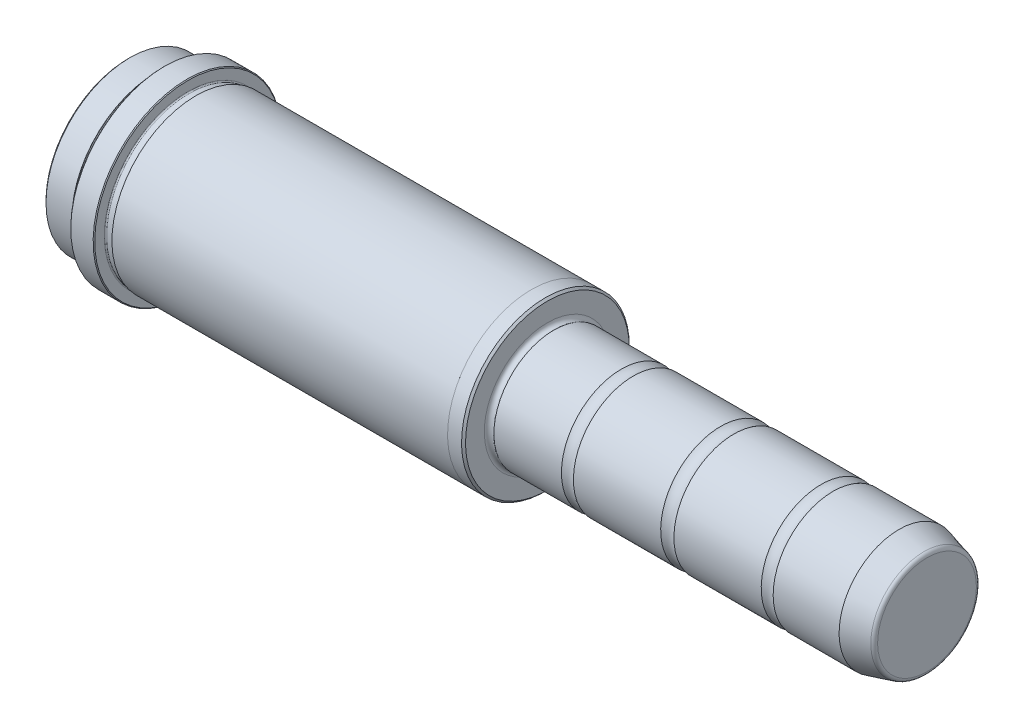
ISO-10303-21;
HEADER;
FILE_DESCRIPTION(('STEP AP214'),'2;1');
FILE_NAME('part.step','',(''),(''),'','','');
FILE_SCHEMA(('AUTOMOTIVE_DESIGN { 1 0 10303 214 1 1 1 1 }'));
ENDSEC;
DATA;
#1=APPLICATION_CONTEXT('core data for automotive mechanical design processes');
#2=APPLICATION_PROTOCOL_DEFINITION('international standard','automotive_design',2000,#1);
#3=PRODUCT_CONTEXT('',#1,'mechanical');
#4=PRODUCT('Part','Part','',(#3));
#5=PRODUCT_RELATED_PRODUCT_CATEGORY('part','',(#4));
#6=PRODUCT_DEFINITION_FORMATION('','',#4);
#7=PRODUCT_DEFINITION_CONTEXT('part definition',#1,'design');
#8=PRODUCT_DEFINITION('design','',#6,#7);
#9=PRODUCT_DEFINITION_SHAPE('','',#8);
#10=(LENGTH_UNIT() NAMED_UNIT(*) SI_UNIT(.MILLI.,.METRE.));
#11=(NAMED_UNIT(*) PLANE_ANGLE_UNIT() SI_UNIT($,.RADIAN.));
#12=(NAMED_UNIT(*) SI_UNIT($,.STERADIAN.) SOLID_ANGLE_UNIT());
#13=UNCERTAINTY_MEASURE_WITH_UNIT(LENGTH_MEASURE(1.E-05),#10,'distance_accuracy_value','');
#14=(GEOMETRIC_REPRESENTATION_CONTEXT(3) GLOBAL_UNCERTAINTY_ASSIGNED_CONTEXT((#13)) GLOBAL_UNIT_ASSIGNED_CONTEXT((#10,
#11,#12)) REPRESENTATION_CONTEXT('',''));
#15=CARTESIAN_POINT('',(0.,0.,0.));
#16=DIRECTION('',(0.,0.,1.));
#17=DIRECTION('',(1.,0.,0.));
#18=AXIS2_PLACEMENT_3D('',#15,#16,#17);
#19=CARTESIAN_POINT('',(95.,0.,0.));
#20=DIRECTION('',(1.,0.,0.));
#21=DIRECTION('',(0.,1.,0.));
#22=AXIS2_PLACEMENT_3D('',#19,#20,#21);
#23=CYLINDRICAL_SURFACE('',#22,15.);
#24=CARTESIAN_POINT('',(1.6,0.,0.));
#25=DIRECTION('',(1.,0.,0.));
#26=DIRECTION('',(0.,1.,0.));
#27=AXIS2_PLACEMENT_3D('',#24,#25,#26);
#28=CIRCLE('',#27,15.);
#29=CARTESIAN_POINT('',(1.6,15.,0.));
#30=VERTEX_POINT('',#29);
#31=EDGE_CURVE('E105',#30,#30,#28,.T.);
#32=ORIENTED_EDGE('',*,*,#31,.T.);
#33=EDGE_LOOP('',(#32));
#34=FACE_BOUND('',#33,.T.);
#35=CARTESIAN_POINT('',(18.5033370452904,0.,0.));
#36=DIRECTION('',(-1.,0.,0.));
#37=DIRECTION('',(0.,-1.,0.));
#38=AXIS2_PLACEMENT_3D('',#35,#36,#37);
#39=CIRCLE('',#38,15.);
#40=CARTESIAN_POINT('',(18.5033370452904,-15.,0.));
#41=VERTEX_POINT('',#40);
#42=EDGE_CURVE('E126',#41,#41,#39,.T.);
#43=ORIENTED_EDGE('',*,*,#42,.T.);
#44=EDGE_LOOP('',(#43));
#45=FACE_BOUND('',#44,.T.);
#46=ADVANCED_FACE('F28',(#34,#45),#23,.T.);
#47=CARTESIAN_POINT('',(-105.,21.,0.));
#48=DIRECTION('',(-1.,0.,0.));
#49=DIRECTION('',(0.,-1.,0.));
#50=AXIS2_PLACEMENT_3D('',#47,#48,#49);
#51=PLANE('',#50);
#52=CARTESIAN_POINT('',(-105.,0.,0.));
#53=DIRECTION('',(-1.,0.,0.));
#54=DIRECTION('',(0.,-1.,0.));
#55=AXIS2_PLACEMENT_3D('',#52,#53,#54);
#56=CIRCLE('',#55,20.5);
#57=CARTESIAN_POINT('',(-105.,-20.5,0.));
#58=VERTEX_POINT('',#57);
#59=EDGE_CURVE('E39',#58,#58,#56,.T.);
#60=ORIENTED_EDGE('',*,*,#59,.T.);
#61=EDGE_LOOP('',(#60));
#62=FACE_BOUND('',#61,.T.);
#63=ADVANCED_FACE('F149',(#62),#51,.T.);
#64=CARTESIAN_POINT('',(95.,0.,0.));
#65=DIRECTION('',(1.,0.,0.));
#66=DIRECTION('',(0.,1.,0.));
#67=AXIS2_PLACEMENT_3D('',#64,#65,#66);
#68=CYLINDRICAL_SURFACE('',#67,21.);
#69=CARTESIAN_POINT('',(-104.5,0.,0.));
#70=DIRECTION('',(-1.,0.,0.));
#71=DIRECTION('',(0.,-1.,0.));
#72=AXIS2_PLACEMENT_3D('',#69,#70,#71);
#73=CIRCLE('',#72,21.);
#74=CARTESIAN_POINT('',(-104.5,-21.,0.));
#75=VERTEX_POINT('',#74);
#76=EDGE_CURVE('E43',#75,#75,#73,.F.);
#77=ORIENTED_EDGE('',*,*,#76,.T.);
#78=EDGE_LOOP('',(#77));
#79=FACE_BOUND('',#78,.T.);
#80=CARTESIAN_POINT('',(-98.,0.,0.));
#81=DIRECTION('',(1.,0.,0.));
#82=DIRECTION('',(0.,1.,0.));
#83=AXIS2_PLACEMENT_3D('',#80,#81,#82);
#84=CIRCLE('',#83,21.);
#85=CARTESIAN_POINT('',(-98.,21.,0.));
#86=VERTEX_POINT('',#85);
#87=EDGE_CURVE('E66',#86,#86,#84,.T.);
#88=ORIENTED_EDGE('',*,*,#87,.F.);
#89=EDGE_LOOP('',(#88));
#90=FACE_BOUND('',#89,.T.);
#91=ADVANCED_FACE('F157',(#79,#90),#68,.T.);
#92=CARTESIAN_POINT('',(-98.,20.9,0.));
#93=DIRECTION('',(1.,0.,0.));
#94=DIRECTION('',(0.,1.,0.));
#95=AXIS2_PLACEMENT_3D('',#92,#93,#94);
#96=PLANE('',#95);
#97=ORIENTED_EDGE('',*,*,#87,.T.);
#98=EDGE_LOOP('',(#97));
#99=FACE_BOUND('',#98,.T.);
#100=CARTESIAN_POINT('',(-98.,0.,0.));
#101=DIRECTION('',(1.,0.,0.));
#102=DIRECTION('',(0.,1.,0.));
#103=AXIS2_PLACEMENT_3D('',#100,#101,#102);
#104=CIRCLE('',#103,20.9);
#105=CARTESIAN_POINT('',(-98.,20.9,0.));
#106=VERTEX_POINT('',#105);
#107=EDGE_CURVE('E69',#106,#106,#104,.T.);
#108=ORIENTED_EDGE('',*,*,#107,.F.);
#109=EDGE_LOOP('',(#108));
#110=FACE_BOUND('',#109,.T.);
#111=ADVANCED_FACE('F405',(#99,#110),#96,.T.);
#112=CARTESIAN_POINT('',(-97.7,0.,0.));
#113=DIRECTION('',(1.,0.,0.));
#114=DIRECTION('',(0.,1.,0.));
#115=AXIS2_PLACEMENT_3D('',#112,#113,#114);
#116=TOROIDAL_SURFACE('',#115,20.9,0.299999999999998);
#117=ORIENTED_EDGE('',*,*,#107,.T.);
#118=EDGE_LOOP('',(#117));
#119=FACE_BOUND('',#118,.T.);
#120=CARTESIAN_POINT('',(-97.7,0.,0.));
#121=DIRECTION('',(1.,0.,0.));
#122=DIRECTION('',(0.,1.,0.));
#123=AXIS2_PLACEMENT_3D('',#120,#121,#122);
#124=CIRCLE('',#123,20.6);
#125=CARTESIAN_POINT('',(-97.7,20.6,0.));
#126=VERTEX_POINT('',#125);
#127=EDGE_CURVE('E72',#126,#126,#124,.T.);
#128=ORIENTED_EDGE('',*,*,#127,.F.);
#129=EDGE_LOOP('',(#128));
#130=FACE_BOUND('',#129,.T.);
#131=ADVANCED_FACE('F396',(#119,#130),#116,.F.);
#132=CARTESIAN_POINT('',(95.,0.,0.));
#133=DIRECTION('',(1.,0.,0.));
#134=DIRECTION('',(0.,1.,0.));
#135=AXIS2_PLACEMENT_3D('',#132,#133,#134);
#136=CYLINDRICAL_SURFACE('',#135,20.6);
#137=ORIENTED_EDGE('',*,*,#127,.T.);
#138=EDGE_LOOP('',(#137));
#139=FACE_BOUND('',#138,.T.);
#140=CARTESIAN_POINT('',(-96.3,0.,0.));
#141=DIRECTION('',(1.,0.,0.));
#142=DIRECTION('',(0.,1.,0.));
#143=AXIS2_PLACEMENT_3D('',#140,#141,#142);
#144=CIRCLE('',#143,20.6);
#145=CARTESIAN_POINT('',(-96.3,20.6,0.));
#146=VERTEX_POINT('',#145);
#147=EDGE_CURVE('E75',#146,#146,#144,.T.);
#148=ORIENTED_EDGE('',*,*,#147,.F.);
#149=EDGE_LOOP('',(#148));
#150=FACE_BOUND('',#149,.T.);
#151=ADVANCED_FACE('F387',(#139,#150),#136,.T.);
#152=CARTESIAN_POINT('',(-96.3,0.,0.));
#153=DIRECTION('',(1.,0.,0.));
#154=DIRECTION('',(0.,1.,0.));
#155=AXIS2_PLACEMENT_3D('',#152,#153,#154);
#156=TOROIDAL_SURFACE('',#155,20.9,0.299999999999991);
#157=ORIENTED_EDGE('',*,*,#147,.T.);
#158=EDGE_LOOP('',(#157));
#159=FACE_BOUND('',#158,.T.);
#160=CARTESIAN_POINT('',(-96.,0.,0.));
#161=DIRECTION('',(1.,0.,0.));
#162=DIRECTION('',(0.,1.,0.));
#163=AXIS2_PLACEMENT_3D('',#160,#161,#162);
#164=CIRCLE('',#163,20.9);
#165=CARTESIAN_POINT('',(-96.,20.9,0.));
#166=VERTEX_POINT('',#165);
#167=EDGE_CURVE('E78',#166,#166,#164,.T.);
#168=ORIENTED_EDGE('',*,*,#167,.F.);
#169=EDGE_LOOP('',(#168));
#170=FACE_BOUND('',#169,.T.);
#171=ADVANCED_FACE('F379',(#159,#170),#156,.F.);
#172=CARTESIAN_POINT('',(-96.,23.5,0.));
#173=DIRECTION('',(-1.,0.,0.));
#174=DIRECTION('',(0.,-1.,0.));
#175=AXIS2_PLACEMENT_3D('',#172,#173,#174);
#176=PLANE('',#175);
#177=CARTESIAN_POINT('',(-96.,0.,0.));
#178=DIRECTION('',(-1.,0.,0.));
#179=DIRECTION('',(0.,-1.,0.));
#180=AXIS2_PLACEMENT_3D('',#177,#178,#179);
#181=CIRCLE('',#180,23.3);
#182=CARTESIAN_POINT('',(-96.,23.3,0.));
#183=VERTEX_POINT('',#182);
#184=EDGE_CURVE('E51',#183,#183,#181,.T.);
#185=ORIENTED_EDGE('',*,*,#184,.T.);
#186=EDGE_LOOP('',(#185));
#187=FACE_BOUND('',#186,.T.);
#188=ORIENTED_EDGE('',*,*,#167,.T.);
#189=EDGE_LOOP('',(#188));
#190=FACE_BOUND('',#189,.T.);
#191=ADVANCED_FACE('F371',(#187,#190),#176,.T.);
#192=CARTESIAN_POINT('',(95.,0.,0.));
#193=DIRECTION('',(1.,0.,0.));
#194=DIRECTION('',(0.,1.,0.));
#195=AXIS2_PLACEMENT_3D('',#192,#193,#194);
#196=CYLINDRICAL_SURFACE('',#195,23.5);
#197=CARTESIAN_POINT('',(-95.8000000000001,0.,0.));
#198=DIRECTION('',(-1.,0.,0.));
#199=DIRECTION('',(0.,-1.,0.));
#200=AXIS2_PLACEMENT_3D('',#197,#198,#199);
#201=CIRCLE('',#200,23.5);
#202=CARTESIAN_POINT('',(-95.8000000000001,23.5,0.));
#203=VERTEX_POINT('',#202);
#204=EDGE_CURVE('E54',#203,#203,#201,.F.);
#205=CARTESIAN_POINT('',(-90.2,0.,0.));
#206=DIRECTION('',(1.,0.,0.));
#207=DIRECTION('',(0.,1.,0.));
#208=AXIS2_PLACEMENT_3D('',#205,#206,#207);
#209=CIRCLE('',#208,23.5);
#210=CARTESIAN_POINT('',(-90.2,23.5,0.));
#211=VERTEX_POINT('',#210);
#212=EDGE_CURVE('E57',#211,#211,#209,.F.);
#213=CARTESIAN_POINT('',(-95.8000000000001,23.5,0.));
#214=CARTESIAN_POINT('',(-95.7416666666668,23.5,0.));
#215=CARTESIAN_POINT('',(-95.6833333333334,23.5,0.));
#216=CARTESIAN_POINT('',(-95.5666666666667,23.5,0.));
#217=CARTESIAN_POINT('',(-95.5083333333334,23.5,0.));
#218=CARTESIAN_POINT('',(-95.3916666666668,23.5,0.));
#219=CARTESIAN_POINT('',(-95.3333333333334,23.5,0.));
#220=CARTESIAN_POINT('',(-95.2166666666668,23.5,0.));
#221=CARTESIAN_POINT('',(-95.1583333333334,23.5,0.));
#222=CARTESIAN_POINT('',(-95.0416666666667,23.5,0.));
#223=CARTESIAN_POINT('',(-94.9833333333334,23.5,0.));
#224=CARTESIAN_POINT('',(-94.8666666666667,23.5,0.));
#225=CARTESIAN_POINT('',(-94.8083333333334,23.5,0.));
#226=CARTESIAN_POINT('',(-94.6916666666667,23.5,0.));
#227=CARTESIAN_POINT('',(-94.6333333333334,23.5,0.));
#228=CARTESIAN_POINT('',(-94.5166666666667,23.5,0.));
#229=CARTESIAN_POINT('',(-94.4583333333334,23.5,0.));
#230=CARTESIAN_POINT('',(-94.3416666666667,23.5,0.));
#231=CARTESIAN_POINT('',(-94.2833333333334,23.5,0.));
#232=CARTESIAN_POINT('',(-94.1666666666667,23.5,0.));
#233=CARTESIAN_POINT('',(-94.1083333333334,23.5,0.));
#234=CARTESIAN_POINT('',(-93.9916666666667,23.5,0.));
#235=CARTESIAN_POINT('',(-93.9333333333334,23.5,0.));
#236=CARTESIAN_POINT('',(-93.8166666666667,23.5,0.));
#237=CARTESIAN_POINT('',(-93.7583333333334,23.5,0.));
#238=CARTESIAN_POINT('',(-93.6416666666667,23.5,0.));
#239=CARTESIAN_POINT('',(-93.5833333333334,23.5,0.));
#240=CARTESIAN_POINT('',(-93.4666666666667,23.5,0.));
#241=CARTESIAN_POINT('',(-93.4083333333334,23.5,0.));
#242=CARTESIAN_POINT('',(-93.2916666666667,23.5,0.));
#243=CARTESIAN_POINT('',(-93.2333333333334,23.5,0.));
#244=CARTESIAN_POINT('',(-93.1166666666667,23.5,0.));
#245=CARTESIAN_POINT('',(-93.0583333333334,23.5,0.));
#246=CARTESIAN_POINT('',(-92.9416666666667,23.5,0.));
#247=CARTESIAN_POINT('',(-92.8833333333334,23.5,0.));
#248=CARTESIAN_POINT('',(-92.7666666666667,23.5,0.));
#249=CARTESIAN_POINT('',(-92.7083333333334,23.5,0.));
#250=CARTESIAN_POINT('',(-92.5916666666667,23.5,0.));
#251=CARTESIAN_POINT('',(-92.5333333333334,23.5,0.));
#252=CARTESIAN_POINT('',(-92.4166666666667,23.5,0.));
#253=CARTESIAN_POINT('',(-92.3583333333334,23.5,0.));
#254=CARTESIAN_POINT('',(-92.2416666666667,23.5,0.));
#255=CARTESIAN_POINT('',(-92.1833333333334,23.5,0.));
#256=CARTESIAN_POINT('',(-92.0666666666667,23.5,0.));
#257=CARTESIAN_POINT('',(-92.0083333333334,23.5,0.));
#258=CARTESIAN_POINT('',(-91.8916666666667,23.5,0.));
#259=CARTESIAN_POINT('',(-91.8333333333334,23.5,0.));
#260=CARTESIAN_POINT('',(-91.7166666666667,23.5,0.));
#261=CARTESIAN_POINT('',(-91.6583333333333,23.5,0.));
#262=CARTESIAN_POINT('',(-91.5416666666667,23.5,0.));
#263=CARTESIAN_POINT('',(-91.4833333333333,23.5,0.));
#264=CARTESIAN_POINT('',(-91.3666666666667,23.5,0.));
#265=CARTESIAN_POINT('',(-91.3083333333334,23.5,0.));
#266=CARTESIAN_POINT('',(-91.1916666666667,23.5,0.));
#267=CARTESIAN_POINT('',(-91.1333333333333,23.5,0.));
#268=CARTESIAN_POINT('',(-91.0166666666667,23.5,0.));
#269=CARTESIAN_POINT('',(-90.9583333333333,23.5,0.));
#270=CARTESIAN_POINT('',(-90.8416666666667,23.5,0.));
#271=CARTESIAN_POINT('',(-90.7833333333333,23.5,0.));
#272=CARTESIAN_POINT('',(-90.6666666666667,23.5,0.));
#273=CARTESIAN_POINT('',(-90.6083333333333,23.5,0.));
#274=CARTESIAN_POINT('',(-90.4916666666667,23.5,0.));
#275=CARTESIAN_POINT('',(-90.4333333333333,23.5,0.));
#276=CARTESIAN_POINT('',(-90.3166666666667,23.5,0.));
#277=CARTESIAN_POINT('',(-90.2583333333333,23.5,0.));
#278=CARTESIAN_POINT('',(-90.2,23.5,0.));
#279=B_SPLINE_CURVE_WITH_KNOTS('',3,(#213,#214,#215,#216,#217,#218,#219,#220,#221,#222,#223,
#224,#225,#226,#227,#228,#229,#230,#231,#232,#233,#234,#235,#236,#237,#238,#239,#240,#241,#242,
#243,#244,#245,#246,#247,#248,#249,#250,#251,#252,#253,#254,#255,#256,#257,#258,#259,#260,#261,
#262,#263,#264,#265,#266,#267,#268,#269,#270,#271,#272,#273,#274,#275,#276,#277,#278),
.UNSPECIFIED.,.F.,.F.,(4,2,2,2,2,2,2,2,2,2,2,2,2,2,2,2,2,2,2,2,2,2,2,2,2,2,2,2,2,2,2,2,4),(0.,
0.175000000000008,0.350000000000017,0.524999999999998,0.700000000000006,0.875000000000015,
1.05000000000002,1.22500000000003,1.40000000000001,1.57500000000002,1.75000000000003,
1.92500000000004,2.10000000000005,2.27500000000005,2.45000000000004,2.62500000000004,
2.80000000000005,2.97500000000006,3.15000000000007,3.32500000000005,3.50000000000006,
3.67500000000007,3.85000000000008,4.02500000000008,4.20000000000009,4.37500000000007,
4.55000000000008,4.72500000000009,4.9000000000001,5.07500000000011,5.25000000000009,
5.4250000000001,5.6000000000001),.UNSPECIFIED.);
#280=EDGE_CURVE('BSEAM362',#203,#211,#279,.T.);
#281=ORIENTED_EDGE('',*,*,#204,.T.);
#282=ORIENTED_EDGE('',*,*,#212,.T.);
#283=ORIENTED_EDGE('',*,*,#280,.T.);
#284=ORIENTED_EDGE('',*,*,#280,.F.);
#285=EDGE_LOOP('',(#281,#283,#282,#284));
#286=FACE_BOUND('',#285,.T.);
#287=ADVANCED_FACE('F362',(#286),#196,.T.);
#288=CARTESIAN_POINT('',(-90.,20.9,0.));
#289=DIRECTION('',(1.,0.,0.));
#290=DIRECTION('',(0.,1.,0.));
#291=AXIS2_PLACEMENT_3D('',#288,#289,#290);
#292=PLANE('',#291);
#293=CARTESIAN_POINT('',(-90.,0.,0.));
#294=DIRECTION('',(1.,0.,0.));
#295=DIRECTION('',(0.,1.,0.));
#296=AXIS2_PLACEMENT_3D('',#293,#294,#295);
#297=CIRCLE('',#296,23.3);
#298=CARTESIAN_POINT('',(-90.,23.3,0.));
#299=VERTEX_POINT('',#298);
#300=EDGE_CURVE('E48',#299,#299,#297,.T.);
#301=ORIENTED_EDGE('',*,*,#300,.T.);
#302=EDGE_LOOP('',(#301));
#303=FACE_BOUND('',#302,.T.);
#304=CARTESIAN_POINT('',(-90.,0.,0.));
#305=DIRECTION('',(1.,0.,0.));
#306=DIRECTION('',(0.,1.,0.));
#307=AXIS2_PLACEMENT_3D('',#304,#305,#306);
#308=CIRCLE('',#307,20.9);
#309=CARTESIAN_POINT('',(-90.,20.9,0.));
#310=VERTEX_POINT('',#309);
#311=EDGE_CURVE('E81',#310,#310,#308,.T.);
#312=ORIENTED_EDGE('',*,*,#311,.F.);
#313=EDGE_LOOP('',(#312));
#314=FACE_BOUND('',#313,.T.);
#315=ADVANCED_FACE('F353',(#303,#314),#292,.T.);
#316=CARTESIAN_POINT('',(-89.7,0.,0.));
#317=DIRECTION('',(1.,0.,0.));
#318=DIRECTION('',(0.,1.,0.));
#319=AXIS2_PLACEMENT_3D('',#316,#317,#318);
#320=TOROIDAL_SURFACE('',#319,20.9,0.299999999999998);
#321=ORIENTED_EDGE('',*,*,#311,.T.);
#322=EDGE_LOOP('',(#321));
#323=FACE_BOUND('',#322,.T.);
#324=CARTESIAN_POINT('',(-89.7,0.,0.));
#325=DIRECTION('',(1.,0.,0.));
#326=DIRECTION('',(0.,1.,0.));
#327=AXIS2_PLACEMENT_3D('',#324,#325,#326);
#328=CIRCLE('',#327,20.6);
#329=CARTESIAN_POINT('',(-89.7,20.6,0.));
#330=VERTEX_POINT('',#329);
#331=EDGE_CURVE('E84',#330,#330,#328,.T.);
#332=ORIENTED_EDGE('',*,*,#331,.F.);
#333=EDGE_LOOP('',(#332));
#334=FACE_BOUND('',#333,.T.);
#335=ADVANCED_FACE('F344',(#323,#334),#320,.F.);
#336=CARTESIAN_POINT('',(95.,0.,0.));
#337=DIRECTION('',(1.,0.,0.));
#338=DIRECTION('',(0.,1.,0.));
#339=AXIS2_PLACEMENT_3D('',#336,#337,#338);
#340=CYLINDRICAL_SURFACE('',#339,20.6);
#341=ORIENTED_EDGE('',*,*,#331,.T.);
#342=EDGE_LOOP('',(#341));
#343=FACE_BOUND('',#342,.T.);
#344=CARTESIAN_POINT('',(-88.3,0.,0.));
#345=DIRECTION('',(1.,0.,0.));
#346=DIRECTION('',(0.,1.,0.));
#347=AXIS2_PLACEMENT_3D('',#344,#345,#346);
#348=CIRCLE('',#347,20.6);
#349=CARTESIAN_POINT('',(-88.3,20.6,0.));
#350=VERTEX_POINT('',#349);
#351=EDGE_CURVE('E87',#350,#350,#348,.T.);
#352=ORIENTED_EDGE('',*,*,#351,.F.);
#353=EDGE_LOOP('',(#352));
#354=FACE_BOUND('',#353,.T.);
#355=ADVANCED_FACE('F335',(#343,#354),#340,.T.);
#356=CARTESIAN_POINT('',(-88.3,0.,0.));
#357=DIRECTION('',(1.,0.,0.));
#358=DIRECTION('',(0.,1.,0.));
#359=AXIS2_PLACEMENT_3D('',#356,#357,#358);
#360=TOROIDAL_SURFACE('',#359,20.9,0.299999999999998);
#361=ORIENTED_EDGE('',*,*,#351,.T.);
#362=EDGE_LOOP('',(#361));
#363=FACE_BOUND('',#362,.T.);
#364=CARTESIAN_POINT('',(-88.,0.,0.));
#365=DIRECTION('',(1.,0.,0.));
#366=DIRECTION('',(0.,1.,0.));
#367=AXIS2_PLACEMENT_3D('',#364,#365,#366);
#368=CIRCLE('',#367,20.9);
#369=CARTESIAN_POINT('',(-88.,20.9,0.));
#370=VERTEX_POINT('',#369);
#371=EDGE_CURVE('E90',#370,#370,#368,.T.);
#372=ORIENTED_EDGE('',*,*,#371,.F.);
#373=EDGE_LOOP('',(#372));
#374=FACE_BOUND('',#373,.T.);
#375=ADVANCED_FACE('F326',(#363,#374),#360,.F.);
#376=CARTESIAN_POINT('',(-88.,21.0001,0.));
#377=DIRECTION('',(-1.,0.,0.));
#378=DIRECTION('',(0.,-1.,0.));
#379=AXIS2_PLACEMENT_3D('',#376,#377,#378);
#380=PLANE('',#379);
#381=ORIENTED_EDGE('',*,*,#371,.T.);
#382=EDGE_LOOP('',(#381));
#383=FACE_BOUND('',#382,.T.);
#384=CARTESIAN_POINT('',(-88.,0.,0.));
#385=DIRECTION('',(1.,0.,0.));
#386=DIRECTION('',(0.,1.,0.));
#387=AXIS2_PLACEMENT_3D('',#384,#385,#386);
#388=CIRCLE('',#387,21.0001);
#389=CARTESIAN_POINT('',(-88.,21.0001,0.));
#390=VERTEX_POINT('',#389);
#391=EDGE_CURVE('E93',#390,#390,#388,.T.);
#392=ORIENTED_EDGE('',*,*,#391,.F.);
#393=EDGE_LOOP('',(#392));
#394=FACE_BOUND('',#393,.T.);
#395=ADVANCED_FACE('F317',(#383,#394),#380,.T.);
#396=CARTESIAN_POINT('',(95.,0.,0.));
#397=DIRECTION('',(1.,0.,0.));
#398=DIRECTION('',(0.,1.,0.));
#399=AXIS2_PLACEMENT_3D('',#396,#397,#398);
#400=CYLINDRICAL_SURFACE('',#399,21.0001);
#401=ORIENTED_EDGE('',*,*,#391,.T.);
#402=EDGE_LOOP('',(#401));
#403=FACE_BOUND('',#402,.T.);
#404=CARTESIAN_POINT('',(-4.,0.,0.));
#405=DIRECTION('',(1.,0.,0.));
#406=DIRECTION('',(0.,1.,0.));
#407=AXIS2_PLACEMENT_3D('',#404,#405,#406);
#408=CIRCLE('',#407,21.0001);
#409=CARTESIAN_POINT('',(-4.00000000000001,21.0001,0.));
#410=VERTEX_POINT('',#409);
#411=EDGE_CURVE('E96',#410,#410,#408,.T.);
#412=ORIENTED_EDGE('',*,*,#411,.F.);
#413=EDGE_LOOP('',(#412));
#414=FACE_BOUND('',#413,.T.);
#415=ADVANCED_FACE('F308',(#403,#414),#400,.T.);
#416=CARTESIAN_POINT('',(-4.,21.0001,0.));
#417=DIRECTION('',(1.,0.,0.));
#418=DIRECTION('',(0.,1.,0.));
#419=AXIS2_PLACEMENT_3D('',#416,#417,#418);
#420=PLANE('',#419);
#421=ORIENTED_EDGE('',*,*,#411,.T.);
#422=EDGE_LOOP('',(#421));
#423=FACE_BOUND('',#422,.T.);
#424=CARTESIAN_POINT('',(-4.,0.,0.));
#425=DIRECTION('',(1.,0.,0.));
#426=DIRECTION('',(0.,1.,0.));
#427=AXIS2_PLACEMENT_3D('',#424,#425,#426);
#428=CIRCLE('',#427,21.);
#429=CARTESIAN_POINT('',(-4.00000000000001,21.,0.));
#430=VERTEX_POINT('',#429);
#431=EDGE_CURVE('E99',#430,#430,#428,.T.);
#432=ORIENTED_EDGE('',*,*,#431,.F.);
#433=EDGE_LOOP('',(#432));
#434=FACE_BOUND('',#433,.T.);
#435=ADVANCED_FACE('F300',(#423,#434),#420,.T.);
#436=CARTESIAN_POINT('',(95.,0.,0.));
#437=DIRECTION('',(1.,0.,0.));
#438=DIRECTION('',(0.,1.,0.));
#439=AXIS2_PLACEMENT_3D('',#436,#437,#438);
#440=CYLINDRICAL_SURFACE('',#439,21.);
#441=CARTESIAN_POINT('',(-0.500000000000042,0.,0.));
#442=DIRECTION('',(1.,0.,0.));
#443=DIRECTION('',(0.,1.,0.));
#444=AXIS2_PLACEMENT_3D('',#441,#442,#443);
#445=CIRCLE('',#444,21.);
#446=CARTESIAN_POINT('',(-0.500000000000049,21.,0.));
#447=VERTEX_POINT('',#446);
#448=EDGE_CURVE('E10',#447,#447,#445,.F.);
#449=ORIENTED_EDGE('',*,*,#448,.T.);
#450=EDGE_LOOP('',(#449));
#451=FACE_BOUND('',#450,.T.);
#452=ORIENTED_EDGE('',*,*,#431,.T.);
#453=EDGE_LOOP('',(#452));
#454=FACE_BOUND('',#453,.T.);
#455=ADVANCED_FACE('F292',(#451,#454),#440,.T.);
#456=CARTESIAN_POINT('',(0.,15.8,0.));
#457=DIRECTION('',(1.,0.,0.));
#458=DIRECTION('',(0.,1.,0.));
#459=AXIS2_PLACEMENT_3D('',#456,#457,#458);
#460=PLANE('',#459);
#461=CARTESIAN_POINT('',(0.,0.,0.));
#462=DIRECTION('',(1.,0.,0.));
#463=DIRECTION('',(0.,1.,0.));
#464=AXIS2_PLACEMENT_3D('',#461,#462,#463);
#465=CIRCLE('',#464,20.5);
#466=CARTESIAN_POINT('',(0.,20.5,0.));
#467=VERTEX_POINT('',#466);
#468=EDGE_CURVE('E35',#467,#467,#465,.T.);
#469=ORIENTED_EDGE('',*,*,#468,.T.);
#470=EDGE_LOOP('',(#469));
#471=FACE_BOUND('',#470,.T.);
#472=CARTESIAN_POINT('',(0.,0.,0.));
#473=DIRECTION('',(1.,0.,0.));
#474=DIRECTION('',(0.,1.,0.));
#475=AXIS2_PLACEMENT_3D('',#472,#473,#474);
#476=CIRCLE('',#475,15.8);
#477=CARTESIAN_POINT('',(0.,15.8,0.));
#478=VERTEX_POINT('',#477);
#479=EDGE_CURVE('E102',#478,#478,#476,.T.);
#480=ORIENTED_EDGE('',*,*,#479,.F.);
#481=EDGE_LOOP('',(#480));
#482=FACE_BOUND('',#481,.T.);
#483=ADVANCED_FACE('F144',(#471,#482),#460,.T.);
#484=CARTESIAN_POINT('',(1.,0.,0.));
#485=DIRECTION('',(1.,0.,0.));
#486=DIRECTION('',(0.,1.,0.));
#487=AXIS2_PLACEMENT_3D('',#484,#485,#486);
#488=TOROIDAL_SURFACE('',#487,15.8,1.);
#489=ORIENTED_EDGE('',*,*,#479,.T.);
#490=EDGE_LOOP('',(#489));
#491=FACE_BOUND('',#490,.T.);
#492=ORIENTED_EDGE('',*,*,#31,.F.);
#493=EDGE_LOOP('',(#492));
#494=FACE_BOUND('',#493,.T.);
#495=ADVANCED_FACE('F134',(#491,#494),#488,.F.);
#496=CARTESIAN_POINT('',(20.,0.,0.));
#497=DIRECTION('',(-1.,0.,0.));
#498=DIRECTION('',(0.,-1.,0.));
#499=AXIS2_PLACEMENT_3D('',#496,#497,#498);
#500=TOROIDAL_SURFACE('',#499,17.6,3.);
#501=CARTESIAN_POINT('',(21.4966629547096,0.,0.));
#502=DIRECTION('',(-1.,0.,0.));
#503=DIRECTION('',(0.,-1.,0.));
#504=AXIS2_PLACEMENT_3D('',#501,#502,#503);
#505=CIRCLE('',#504,15.);
#506=CARTESIAN_POINT('',(21.4966629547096,-15.,0.));
#507=VERTEX_POINT('',#506);
#508=EDGE_CURVE('E123',#507,#507,#505,.T.);
#509=ORIENTED_EDGE('',*,*,#508,.T.);
#510=EDGE_LOOP('',(#509));
#511=FACE_BOUND('',#510,.T.);
#512=ORIENTED_EDGE('',*,*,#42,.F.);
#513=EDGE_LOOP('',(#512));
#514=FACE_BOUND('',#513,.T.);
#515=ADVANCED_FACE('F131',(#511,#514),#500,.F.);
#516=CARTESIAN_POINT('',(95.,13.1243556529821,0.));
#517=DIRECTION('',(1.,0.,0.));
#518=DIRECTION('',(0.,1.,0.));
#519=AXIS2_PLACEMENT_3D('',#516,#517,#518);
#520=PLANE('',#519);
#521=CARTESIAN_POINT('',(95.,0.,0.));
#522=DIRECTION('',(1.,0.,0.));
#523=DIRECTION('',(0.,1.,0.));
#524=AXIS2_PLACEMENT_3D('',#521,#522,#523);
#525=CIRCLE('',#524,12.3570286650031);
#526=CARTESIAN_POINT('',(95.,12.3570286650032,0.));
#527=VERTEX_POINT('',#526);
#528=EDGE_CURVE('E63',#527,#527,#525,.T.);
#529=ORIENTED_EDGE('',*,*,#528,.T.);
#530=EDGE_LOOP('',(#529));
#531=FACE_BOUND('',#530,.T.);
#532=ADVANCED_FACE('F133',(#531),#520,.T.);
#533=CARTESIAN_POINT('',(95.,0.,0.));
#534=DIRECTION('',(-1.,0.,0.));
#535=DIRECTION('',(0.,-1.,0.));
#536=AXIS2_PLACEMENT_3D('',#533,#534,#535);
#537=CONICAL_SURFACE('',#536,13.1243556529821,0.261799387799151);
#538=CARTESIAN_POINT('',(94.2588190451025,0.,0.));
#539=DIRECTION('',(1.,0.,0.));
#540=DIRECTION('',(0.,1.,0.));
#541=AXIS2_PLACEMENT_3D('',#538,#539,#540);
#542=CIRCLE('',#541,13.3229544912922);
#543=CARTESIAN_POINT('',(94.2588190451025,13.3229544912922,0.));
#544=VERTEX_POINT('',#543);
#545=EDGE_CURVE('E60',#544,#544,#542,.F.);
#546=ORIENTED_EDGE('',*,*,#545,.T.);
#547=EDGE_LOOP('',(#546));
#548=FACE_BOUND('',#547,.T.);
#549=CARTESIAN_POINT('',(88.,0.,0.));
#550=DIRECTION('',(1.,0.,0.));
#551=DIRECTION('',(0.,1.,0.));
#552=AXIS2_PLACEMENT_3D('',#549,#550,#551);
#553=CIRCLE('',#552,15.);
#554=CARTESIAN_POINT('',(88.,15.,0.));
#555=VERTEX_POINT('',#554);
#556=EDGE_CURVE('E108',#555,#555,#553,.T.);
#557=ORIENTED_EDGE('',*,*,#556,.T.);
#558=EDGE_LOOP('',(#557));
#559=FACE_BOUND('',#558,.T.);
#560=ADVANCED_FACE('F141',(#548,#559),#537,.T.);
#561=ORIENTED_EDGE('',*,*,#556,.F.);
#562=EDGE_LOOP('',(#561));
#563=FACE_BOUND('',#562,.T.);
#564=CARTESIAN_POINT('',(71.4966629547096,0.,0.));
#565=DIRECTION('',(-1.,0.,0.));
#566=DIRECTION('',(0.,-1.,0.));
#567=AXIS2_PLACEMENT_3D('',#564,#565,#566);
#568=CIRCLE('',#567,15.);
#569=CARTESIAN_POINT('',(71.4966629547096,-15.,0.));
#570=VERTEX_POINT('',#569);
#571=EDGE_CURVE('E111',#570,#570,#568,.T.);
#572=ORIENTED_EDGE('',*,*,#571,.F.);
#573=EDGE_LOOP('',(#572));
#574=FACE_BOUND('',#573,.T.);
#575=ADVANCED_FACE('F153',(#563,#574),#23,.T.);
#576=CARTESIAN_POINT('',(70.,0.,0.));
#577=DIRECTION('',(-1.,0.,0.));
#578=DIRECTION('',(0.,-1.,0.));
#579=AXIS2_PLACEMENT_3D('',#576,#577,#578);
#580=TOROIDAL_SURFACE('',#579,17.6,3.);
#581=ORIENTED_EDGE('',*,*,#571,.T.);
#582=EDGE_LOOP('',(#581));
#583=FACE_BOUND('',#582,.T.);
#584=CARTESIAN_POINT('',(68.5033370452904,0.,0.));
#585=DIRECTION('',(-1.,0.,0.));
#586=DIRECTION('',(0.,-1.,0.));
#587=AXIS2_PLACEMENT_3D('',#584,#585,#586);
#588=CIRCLE('',#587,15.);
#589=CARTESIAN_POINT('',(68.5033370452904,-15.,0.));
#590=VERTEX_POINT('',#589);
#591=EDGE_CURVE('E114',#590,#590,#588,.T.);
#592=ORIENTED_EDGE('',*,*,#591,.F.);
#593=EDGE_LOOP('',(#592));
#594=FACE_BOUND('',#593,.T.);
#595=ADVANCED_FACE('F167',(#583,#594),#580,.F.);
#596=ORIENTED_EDGE('',*,*,#591,.T.);
#597=EDGE_LOOP('',(#596));
#598=FACE_BOUND('',#597,.T.);
#599=CARTESIAN_POINT('',(46.6583123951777,0.,0.));
#600=DIRECTION('',(-1.,0.,0.));
#601=DIRECTION('',(0.,-1.,0.));
#602=AXIS2_PLACEMENT_3D('',#599,#600,#601);
#603=CIRCLE('',#602,15.);
#604=CARTESIAN_POINT('',(46.6583123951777,-15.,0.));
#605=VERTEX_POINT('',#604);
#606=EDGE_CURVE('E117',#605,#605,#603,.T.);
#607=ORIENTED_EDGE('',*,*,#606,.F.);
#608=EDGE_LOOP('',(#607));
#609=FACE_BOUND('',#608,.T.);
#610=ADVANCED_FACE('F165',(#598,#609),#23,.T.);
#611=CARTESIAN_POINT('',(45.,0.,0.));
#612=DIRECTION('',(-1.,0.,0.));
#613=DIRECTION('',(0.,-1.,0.));
#614=AXIS2_PLACEMENT_3D('',#611,#612,#613);
#615=TOROIDAL_SURFACE('',#614,17.5,3.);
#616=ORIENTED_EDGE('',*,*,#606,.T.);
#617=EDGE_LOOP('',(#616));
#618=FACE_BOUND('',#617,.T.);
#619=CARTESIAN_POINT('',(43.3416876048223,0.,0.));
#620=DIRECTION('',(-1.,0.,0.));
#621=DIRECTION('',(0.,-1.,0.));
#622=AXIS2_PLACEMENT_3D('',#619,#620,#621);
#623=CIRCLE('',#622,15.);
#624=CARTESIAN_POINT('',(43.3416876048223,-15.,0.));
#625=VERTEX_POINT('',#624);
#626=EDGE_CURVE('E120',#625,#625,#623,.T.);
#627=ORIENTED_EDGE('',*,*,#626,.F.);
#628=EDGE_LOOP('',(#627));
#629=FACE_BOUND('',#628,.T.);
#630=ADVANCED_FACE('F163',(#618,#629),#615,.F.);
#631=ORIENTED_EDGE('',*,*,#626,.T.);
#632=EDGE_LOOP('',(#631));
#633=FACE_BOUND('',#632,.T.);
#634=ORIENTED_EDGE('',*,*,#508,.F.);
#635=EDGE_LOOP('',(#634));
#636=FACE_BOUND('',#635,.T.);
#637=ADVANCED_FACE('F152',(#633,#636),#23,.T.);
#638=CARTESIAN_POINT('',(94.,0.,0.));
#639=DIRECTION('',(1.,0.,0.));
#640=DIRECTION('',(0.,1.,0.));
#641=AXIS2_PLACEMENT_3D('',#638,#639,#640);
#642=TOROIDAL_SURFACE('',#641,12.3570286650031,1.);
#643=ORIENTED_EDGE('',*,*,#545,.F.);
#644=EDGE_LOOP('',(#643));
#645=FACE_BOUND('',#644,.T.);
#646=ORIENTED_EDGE('',*,*,#528,.F.);
#647=EDGE_LOOP('',(#646));
#648=FACE_BOUND('',#647,.T.);
#649=ADVANCED_FACE('F162',(#645,#648),#642,.T.);
#650=CARTESIAN_POINT('',(-95.8000000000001,0.,0.));
#651=DIRECTION('',(1.,0.,0.));
#652=DIRECTION('',(0.,1.,0.));
#653=AXIS2_PLACEMENT_3D('',#650,#651,#652);
#654=CONICAL_SURFACE('',#653,23.5,0.78539816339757);
#655=CARTESIAN_POINT('',(-96.,23.3,0.));
#656=CARTESIAN_POINT('',(-95.9979166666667,23.3020833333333,0.));
#657=CARTESIAN_POINT('',(-95.9958333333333,23.3041666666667,0.));
#658=CARTESIAN_POINT('',(-95.9916666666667,23.3083333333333,0.));
#659=CARTESIAN_POINT('',(-95.9895833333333,23.3104166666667,0.));
#660=CARTESIAN_POINT('',(-95.9854166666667,23.3145833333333,0.));
#661=CARTESIAN_POINT('',(-95.9833333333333,23.3166666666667,0.));
#662=CARTESIAN_POINT('',(-95.9791666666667,23.3208333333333,0.));
#663=CARTESIAN_POINT('',(-95.9770833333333,23.3229166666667,0.));
#664=CARTESIAN_POINT('',(-95.9729166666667,23.3270833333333,0.));
#665=CARTESIAN_POINT('',(-95.9708333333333,23.3291666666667,0.));
#666=CARTESIAN_POINT('',(-95.9666666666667,23.3333333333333,0.));
#667=CARTESIAN_POINT('',(-95.9645833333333,23.3354166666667,0.));
#668=CARTESIAN_POINT('',(-95.9604166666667,23.3395833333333,0.));
#669=CARTESIAN_POINT('',(-95.9583333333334,23.3416666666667,0.));
#670=CARTESIAN_POINT('',(-95.9541666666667,23.3458333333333,0.));
#671=CARTESIAN_POINT('',(-95.9520833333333,23.3479166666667,0.));
#672=CARTESIAN_POINT('',(-95.9479166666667,23.3520833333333,0.));
#673=CARTESIAN_POINT('',(-95.9458333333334,23.3541666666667,0.));
#674=CARTESIAN_POINT('',(-95.9416666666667,23.3583333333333,0.));
#675=CARTESIAN_POINT('',(-95.9395833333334,23.3604166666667,0.));
#676=CARTESIAN_POINT('',(-95.9354166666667,23.3645833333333,0.));
#677=CARTESIAN_POINT('',(-95.9333333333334,23.3666666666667,0.));
#678=CARTESIAN_POINT('',(-95.9291666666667,23.3708333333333,0.));
#679=CARTESIAN_POINT('',(-95.9270833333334,23.3729166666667,0.));
#680=CARTESIAN_POINT('',(-95.9229166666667,23.3770833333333,0.));
#681=CARTESIAN_POINT('',(-95.9208333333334,23.3791666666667,0.));
#682=CARTESIAN_POINT('',(-95.9166666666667,23.3833333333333,0.));
#683=CARTESIAN_POINT('',(-95.9145833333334,23.3854166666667,0.));
#684=CARTESIAN_POINT('',(-95.9104166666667,23.3895833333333,0.));
#685=CARTESIAN_POINT('',(-95.9083333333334,23.3916666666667,0.));
#686=CARTESIAN_POINT('',(-95.9041666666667,23.3958333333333,0.));
#687=CARTESIAN_POINT('',(-95.9020833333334,23.3979166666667,0.));
#688=CARTESIAN_POINT('',(-95.8979166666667,23.4020833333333,0.));
#689=CARTESIAN_POINT('',(-95.8958333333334,23.4041666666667,0.));
#690=CARTESIAN_POINT('',(-95.8916666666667,23.4083333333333,0.));
#691=CARTESIAN_POINT('',(-95.8895833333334,23.4104166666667,0.));
#692=CARTESIAN_POINT('',(-95.8854166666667,23.4145833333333,0.));
#693=CARTESIAN_POINT('',(-95.8833333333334,23.4166666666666,0.));
#694=CARTESIAN_POINT('',(-95.8791666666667,23.4208333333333,0.));
#695=CARTESIAN_POINT('',(-95.8770833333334,23.4229166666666,0.));
#696=CARTESIAN_POINT('',(-95.8729166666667,23.4270833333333,0.));
#697=CARTESIAN_POINT('',(-95.8708333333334,23.4291666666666,0.));
#698=CARTESIAN_POINT('',(-95.8666666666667,23.4333333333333,0.));
#699=CARTESIAN_POINT('',(-95.8645833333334,23.4354166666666,0.));
#700=CARTESIAN_POINT('',(-95.8604166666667,23.4395833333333,0.));
#701=CARTESIAN_POINT('',(-95.8583333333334,23.4416666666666,0.));
#702=CARTESIAN_POINT('',(-95.8541666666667,23.4458333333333,0.));
#703=CARTESIAN_POINT('',(-95.8520833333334,23.4479166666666,0.));
#704=CARTESIAN_POINT('',(-95.8479166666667,23.4520833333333,0.));
#705=CARTESIAN_POINT('',(-95.8458333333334,23.4541666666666,0.));
#706=CARTESIAN_POINT('',(-95.8416666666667,23.4583333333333,0.));
#707=CARTESIAN_POINT('',(-95.8395833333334,23.4604166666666,0.));
#708=CARTESIAN_POINT('',(-95.8354166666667,23.4645833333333,0.));
#709=CARTESIAN_POINT('',(-95.8333333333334,23.4666666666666,0.));
#710=CARTESIAN_POINT('',(-95.8291666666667,23.4708333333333,0.));
#711=CARTESIAN_POINT('',(-95.8270833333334,23.4729166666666,0.));
#712=CARTESIAN_POINT('',(-95.8229166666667,23.4770833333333,0.));
#713=CARTESIAN_POINT('',(-95.8208333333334,23.4791666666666,0.));
#714=CARTESIAN_POINT('',(-95.8166666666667,23.4833333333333,0.));
#715=CARTESIAN_POINT('',(-95.8145833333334,23.4854166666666,0.));
#716=CARTESIAN_POINT('',(-95.8104166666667,23.4895833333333,0.));
#717=CARTESIAN_POINT('',(-95.8083333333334,23.4916666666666,0.));
#718=CARTESIAN_POINT('',(-95.8041666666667,23.4958333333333,0.));
#719=CARTESIAN_POINT('',(-95.8020833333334,23.4979166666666,0.));
#720=CARTESIAN_POINT('',(-95.8000000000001,23.5,0.));
#721=B_SPLINE_CURVE_WITH_KNOTS('',3,(#655,#656,#657,#658,#659,#660,#661,#662,#663,#664,#665,
#666,#667,#668,#669,#670,#671,#672,#673,#674,#675,#676,#677,#678,#679,#680,#681,#682,#683,#684,
#685,#686,#687,#688,#689,#690,#691,#692,#693,#694,#695,#696,#697,#698,#699,#700,#701,#702,#703,
#704,#705,#706,#707,#708,#709,#710,#711,#712,#713,#714,#715,#716,#717,#718,#719,#720),
.UNSPECIFIED.,.F.,.F.,(4,2,2,2,2,2,2,2,2,2,2,2,2,2,2,2,2,2,2,2,2,2,2,2,2,2,2,2,2,2,2,2,4),(0.,
0.00883883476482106,0.0176776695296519,0.0265165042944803,0.0353553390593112,0.0441941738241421,
0.0530330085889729,0.061871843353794,0.0707106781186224,0.0795495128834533,0.0883883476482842,
0.097227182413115,0.106066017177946,0.114904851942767,0.123743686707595,0.132582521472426,
0.141421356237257,0.150260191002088,0.159099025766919,0.167937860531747,0.176776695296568,
0.185615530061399,0.19445436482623,0.203293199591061,0.212132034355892,0.22097086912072,
0.229809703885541,0.238648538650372,0.247487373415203,0.256326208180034,0.265165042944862,
0.274003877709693,0.282842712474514),.UNSPECIFIED.);
#722=EDGE_CURVE('BSEAM205',#183,#203,#721,.T.);
#723=ORIENTED_EDGE('',*,*,#184,.F.);
#724=ORIENTED_EDGE('',*,*,#204,.F.);
#725=ORIENTED_EDGE('',*,*,#722,.T.);
#726=ORIENTED_EDGE('',*,*,#722,.F.);
#727=EDGE_LOOP('',(#723,#725,#724,#726));
#728=FACE_BOUND('',#727,.T.);
#729=ADVANCED_FACE('F205',(#728),#654,.T.);
#730=CARTESIAN_POINT('',(-90.,0.,0.));
#731=DIRECTION('',(-1.,0.,0.));
#732=DIRECTION('',(0.,-1.,0.));
#733=AXIS2_PLACEMENT_3D('',#730,#731,#732);
#734=CONICAL_SURFACE('',#733,23.3,0.785398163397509);
#735=ORIENTED_EDGE('',*,*,#212,.F.);
#736=EDGE_LOOP('',(#735));
#737=FACE_BOUND('',#736,.T.);
#738=ORIENTED_EDGE('',*,*,#300,.F.);
#739=EDGE_LOOP('',(#738));
#740=FACE_BOUND('',#739,.T.);
#741=ADVANCED_FACE('F215',(#737,#740),#734,.T.);
#742=CARTESIAN_POINT('',(-104.5,0.,0.));
#743=DIRECTION('',(1.,0.,0.));
#744=DIRECTION('',(0.,1.,0.));
#745=AXIS2_PLACEMENT_3D('',#742,#743,#744);
#746=CONICAL_SURFACE('',#745,21.,0.785398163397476);
#747=ORIENTED_EDGE('',*,*,#59,.F.);
#748=EDGE_LOOP('',(#747));
#749=FACE_BOUND('',#748,.T.);
#750=ORIENTED_EDGE('',*,*,#76,.F.);
#751=EDGE_LOOP('',(#750));
#752=FACE_BOUND('',#751,.T.);
#753=ADVANCED_FACE('F224',(#749,#752),#746,.T.);
#754=CARTESIAN_POINT('',(0.,0.,0.));
#755=DIRECTION('',(-1.,0.,0.));
#756=DIRECTION('',(0.,-1.,0.));
#757=AXIS2_PLACEMENT_3D('',#754,#755,#756);
#758=CONICAL_SURFACE('',#757,20.5,0.785398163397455);
#759=ORIENTED_EDGE('',*,*,#448,.F.);
#760=EDGE_LOOP('',(#759));
#761=FACE_BOUND('',#760,.T.);
#762=ORIENTED_EDGE('',*,*,#468,.F.);
#763=EDGE_LOOP('',(#762));
#764=FACE_BOUND('',#763,.T.);
#765=ADVANCED_FACE('F30',(#761,#764),#758,.T.);
#766=CLOSED_SHELL('',(#46,#63,#91,#111,#131,#151,#171,#191,#287,#315,#335,#355,#375,#395,#415,
#435,#455,#483,#495,#515,#532,#560,#575,#595,#610,#630,#637,#649,#729,#741,#753,#765));
#767=MANIFOLD_SOLID_BREP('B2',#766);
#768=ADVANCED_BREP_SHAPE_REPRESENTATION('',(#18,#767),#14);
#769=SHAPE_DEFINITION_REPRESENTATION(#9,#768);
ENDSEC;
END-ISO-10303-21;
